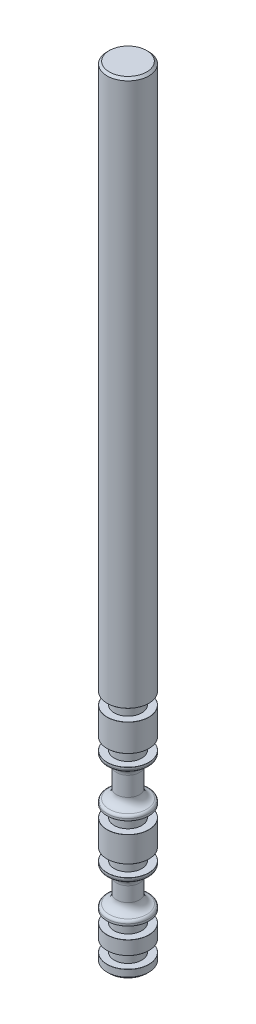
ISO-10303-21;
HEADER;
FILE_DESCRIPTION(('STEP AP214'),'2;1');
FILE_NAME('part.step','',(''),(''),'','','');
FILE_SCHEMA(('AUTOMOTIVE_DESIGN { 1 0 10303 214 1 1 1 1 }'));
ENDSEC;
DATA;
#1=APPLICATION_CONTEXT('core data for automotive mechanical design processes');
#2=APPLICATION_PROTOCOL_DEFINITION('international standard','automotive_design',2000,#1);
#3=PRODUCT_CONTEXT('',#1,'mechanical');
#4=PRODUCT('Part','Part','',(#3));
#5=PRODUCT_RELATED_PRODUCT_CATEGORY('part','',(#4));
#6=PRODUCT_DEFINITION_FORMATION('','',#4);
#7=PRODUCT_DEFINITION_CONTEXT('part definition',#1,'design');
#8=PRODUCT_DEFINITION('design','',#6,#7);
#9=PRODUCT_DEFINITION_SHAPE('','',#8);
#10=(LENGTH_UNIT() NAMED_UNIT(*) SI_UNIT(.MILLI.,.METRE.));
#11=(NAMED_UNIT(*) PLANE_ANGLE_UNIT() SI_UNIT($,.RADIAN.));
#12=(NAMED_UNIT(*) SI_UNIT($,.STERADIAN.) SOLID_ANGLE_UNIT());
#13=UNCERTAINTY_MEASURE_WITH_UNIT(LENGTH_MEASURE(1.E-05),#10,'distance_accuracy_value','');
#14=(GEOMETRIC_REPRESENTATION_CONTEXT(3) GLOBAL_UNCERTAINTY_ASSIGNED_CONTEXT((#13)) GLOBAL_UNIT_ASSIGNED_CONTEXT((#10,
#11,#12)) REPRESENTATION_CONTEXT('',''));
#15=CARTESIAN_POINT('',(0.,0.,0.));
#16=DIRECTION('',(0.,0.,1.));
#17=DIRECTION('',(1.,0.,0.));
#18=AXIS2_PLACEMENT_3D('',#15,#16,#17);
#19=CARTESIAN_POINT('',(0.,-5.94663666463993,0.));
#20=DIRECTION('',(0.,-1.,0.));
#21=DIRECTION('',(0.,0.,-1.));
#22=AXIS2_PLACEMENT_3D('',#19,#20,#21);
#23=CYLINDRICAL_SURFACE('',#22,2.29500000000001);
#24=CARTESIAN_POINT('',(0.,0.250000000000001,0.));
#25=DIRECTION('',(0.,-1.,0.));
#26=DIRECTION('',(0.,0.,-1.));
#27=AXIS2_PLACEMENT_3D('',#24,#25,#26);
#28=CIRCLE('',#27,2.29500000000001);
#29=CARTESIAN_POINT('',(0.,0.250000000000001,-2.29500000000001));
#30=VERTEX_POINT('',#29);
#31=EDGE_CURVE('E45',#30,#30,#28,.F.);
#32=ORIENTED_EDGE('',*,*,#31,.T.);
#33=EDGE_LOOP('',(#32));
#34=FACE_BOUND('',#33,.T.);
#35=CARTESIAN_POINT('',(0.,0.989999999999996,0.));
#36=DIRECTION('',(0.,1.,0.));
#37=DIRECTION('',(0.,0.,1.));
#38=AXIS2_PLACEMENT_3D('',#35,#36,#37);
#39=CIRCLE('',#38,2.29500000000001);
#40=CARTESIAN_POINT('',(0.,0.989999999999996,2.29500000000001));
#41=VERTEX_POINT('',#40);
#42=EDGE_CURVE('E57',#41,#41,#39,.F.);
#43=ORIENTED_EDGE('',*,*,#42,.T.);
#44=EDGE_LOOP('',(#43));
#45=FACE_BOUND('',#44,.T.);
#46=ADVANCED_FACE('F34',(#34,#45),#23,.T.);
#47=CARTESIAN_POINT('',(2.29500000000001,0.,0.));
#48=DIRECTION('',(0.,-1.,0.));
#49=DIRECTION('',(0.,0.,-1.));
#50=AXIS2_PLACEMENT_3D('',#47,#48,#49);
#51=PLANE('',#50);
#52=CARTESIAN_POINT('',(0.,0.,0.));
#53=DIRECTION('',(0.,-1.,0.));
#54=DIRECTION('',(0.,0.,-1.));
#55=AXIS2_PLACEMENT_3D('',#52,#53,#54);
#56=CIRCLE('',#55,2.045);
#57=CARTESIAN_POINT('',(0.,0.,-2.045));
#58=VERTEX_POINT('',#57);
#59=EDGE_CURVE('E49',#58,#58,#56,.T.);
#60=ORIENTED_EDGE('',*,*,#59,.T.);
#61=EDGE_LOOP('',(#60));
#62=FACE_BOUND('',#61,.T.);
#63=ADVANCED_FACE('F220',(#62),#51,.T.);
#64=CARTESIAN_POINT('',(2.5384511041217,2.3,0.));
#65=DIRECTION('',(0.,-1.,0.));
#66=DIRECTION('',(0.,0.,-1.));
#67=AXIS2_PLACEMENT_3D('',#64,#65,#66);
#68=PLANE('',#67);
#69=CARTESIAN_POINT('',(0.,2.3,0.));
#70=DIRECTION('',(0.,-1.,0.));
#71=DIRECTION('',(0.,0.,-1.));
#72=AXIS2_PLACEMENT_3D('',#69,#70,#71);
#73=CIRCLE('',#72,2.285);
#74=CARTESIAN_POINT('',(0.,2.3,2.285));
#75=VERTEX_POINT('',#74);
#76=EDGE_CURVE('E60',#75,#75,#73,.T.);
#77=ORIENTED_EDGE('',*,*,#76,.T.);
#78=EDGE_LOOP('',(#77));
#79=FACE_BOUND('',#78,.T.);
#80=CARTESIAN_POINT('',(0.,2.3,0.));
#81=DIRECTION('',(0.,1.,0.));
#82=DIRECTION('',(0.,0.,1.));
#83=AXIS2_PLACEMENT_3D('',#80,#81,#82);
#84=CIRCLE('',#83,1.51000000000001);
#85=CARTESIAN_POINT('',(0.,2.3,1.51000000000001));
#86=VERTEX_POINT('',#85);
#87=EDGE_CURVE('E180',#86,#86,#84,.T.);
#88=ORIENTED_EDGE('',*,*,#87,.T.);
#89=EDGE_LOOP('',(#88));
#90=FACE_BOUND('',#89,.T.);
#91=ADVANCED_FACE('F226',(#79,#90),#68,.T.);
#92=CARTESIAN_POINT('',(0.,86.3656873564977,0.));
#93=DIRECTION('',(0.,1.,0.));
#94=DIRECTION('',(0.,0.,1.));
#95=AXIS2_PLACEMENT_3D('',#92,#93,#94);
#96=CYLINDRICAL_SURFACE('',#95,1.51000000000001);
#97=CARTESIAN_POINT('',(0.,1.,0.));
#98=DIRECTION('',(0.,1.,0.));
#99=DIRECTION('',(0.,0.,1.));
#100=AXIS2_PLACEMENT_3D('',#97,#98,#99);
#101=CIRCLE('',#100,1.51000000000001);
#102=CARTESIAN_POINT('',(0.,1.,1.51000000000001));
#103=VERTEX_POINT('',#102);
#104=EDGE_CURVE('E183',#103,#103,#101,.T.);
#105=ORIENTED_EDGE('',*,*,#104,.T.);
#106=EDGE_LOOP('',(#105));
#107=FACE_BOUND('',#106,.T.);
#108=ORIENTED_EDGE('',*,*,#87,.F.);
#109=EDGE_LOOP('',(#108));
#110=FACE_BOUND('',#109,.T.);
#111=ADVANCED_FACE('F247',(#107,#110),#96,.T.);
#112=CARTESIAN_POINT('',(1.51000000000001,1.,0.));
#113=DIRECTION('',(0.,1.,0.));
#114=DIRECTION('',(0.,0.,1.));
#115=AXIS2_PLACEMENT_3D('',#112,#113,#114);
#116=PLANE('',#115);
#117=CARTESIAN_POINT('',(0.,1.,0.));
#118=DIRECTION('',(0.,1.,0.));
#119=DIRECTION('',(0.,0.,1.));
#120=AXIS2_PLACEMENT_3D('',#117,#118,#119);
#121=CIRCLE('',#120,2.285);
#122=CARTESIAN_POINT('',(0.,1.,2.285));
#123=VERTEX_POINT('',#122);
#124=EDGE_CURVE('E54',#123,#123,#121,.T.);
#125=ORIENTED_EDGE('',*,*,#124,.T.);
#126=EDGE_LOOP('',(#125));
#127=FACE_BOUND('',#126,.T.);
#128=ORIENTED_EDGE('',*,*,#104,.F.);
#129=EDGE_LOOP('',(#128));
#130=FACE_BOUND('',#129,.T.);
#131=ADVANCED_FACE('F237',(#127,#130),#116,.T.);
#132=CARTESIAN_POINT('',(0.,3.79,0.));
#133=DIRECTION('',(0.,1.,0.));
#134=DIRECTION('',(0.,0.,1.));
#135=AXIS2_PLACEMENT_3D('',#132,#133,#134);
#136=CIRCLE('',#135,2.29500000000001);
#137=CARTESIAN_POINT('',(0.,3.79,2.29500000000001));
#138=VERTEX_POINT('',#137);
#139=EDGE_CURVE('E66',#138,#138,#136,.F.);
#140=ORIENTED_EDGE('',*,*,#139,.T.);
#141=EDGE_LOOP('',(#140));
#142=FACE_BOUND('',#141,.T.);
#143=CARTESIAN_POINT('',(0.,2.31000000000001,0.));
#144=DIRECTION('',(0.,-1.,0.));
#145=DIRECTION('',(0.,0.,-1.));
#146=AXIS2_PLACEMENT_3D('',#143,#144,#145);
#147=CIRCLE('',#146,2.29500000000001);
#148=CARTESIAN_POINT('',(0.,2.31000000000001,2.29500000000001));
#149=VERTEX_POINT('',#148);
#150=EDGE_CURVE('E69',#149,#149,#147,.F.);
#151=ORIENTED_EDGE('',*,*,#150,.T.);
#152=EDGE_LOOP('',(#151));
#153=FACE_BOUND('',#152,.T.);
#154=ADVANCED_FACE('F222',(#142,#153),#23,.T.);
#155=CARTESIAN_POINT('',(2.53845110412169,5.1,0.));
#156=DIRECTION('',(0.,-1.,0.));
#157=DIRECTION('',(0.,0.,-1.));
#158=AXIS2_PLACEMENT_3D('',#155,#156,#157);
#159=PLANE('',#158);
#160=CARTESIAN_POINT('',(0.,5.1,0.));
#161=DIRECTION('',(0.,-1.,0.));
#162=DIRECTION('',(0.,0.,-1.));
#163=AXIS2_PLACEMENT_3D('',#160,#161,#162);
#164=CIRCLE('',#163,2.285);
#165=CARTESIAN_POINT('',(0.,5.1,2.285));
#166=VERTEX_POINT('',#165);
#167=EDGE_CURVE('E72',#166,#166,#164,.T.);
#168=ORIENTED_EDGE('',*,*,#167,.T.);
#169=EDGE_LOOP('',(#168));
#170=FACE_BOUND('',#169,.T.);
#171=CARTESIAN_POINT('',(0.,5.09999999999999,0.));
#172=DIRECTION('',(0.,1.,0.));
#173=DIRECTION('',(0.,0.,1.));
#174=AXIS2_PLACEMENT_3D('',#171,#172,#173);
#175=CIRCLE('',#174,1.51000000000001);
#176=CARTESIAN_POINT('',(0.,5.09999999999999,1.51000000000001));
#177=VERTEX_POINT('',#176);
#178=EDGE_CURVE('E174',#177,#177,#175,.T.);
#179=ORIENTED_EDGE('',*,*,#178,.T.);
#180=EDGE_LOOP('',(#179));
#181=FACE_BOUND('',#180,.T.);
#182=ADVANCED_FACE('F236',(#170,#181),#159,.T.);
#183=CARTESIAN_POINT('',(0.,86.3656873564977,0.));
#184=DIRECTION('',(0.,1.,0.));
#185=DIRECTION('',(0.,0.,1.));
#186=AXIS2_PLACEMENT_3D('',#183,#184,#185);
#187=CYLINDRICAL_SURFACE('',#186,1.51000000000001);
#188=CARTESIAN_POINT('',(0.,3.8,0.));
#189=DIRECTION('',(0.,1.,0.));
#190=DIRECTION('',(0.,0.,1.));
#191=AXIS2_PLACEMENT_3D('',#188,#189,#190);
#192=CIRCLE('',#191,1.51000000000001);
#193=CARTESIAN_POINT('',(0.,3.8,1.51000000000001));
#194=VERTEX_POINT('',#193);
#195=EDGE_CURVE('E177',#194,#194,#192,.T.);
#196=ORIENTED_EDGE('',*,*,#195,.T.);
#197=EDGE_LOOP('',(#196));
#198=FACE_BOUND('',#197,.T.);
#199=ORIENTED_EDGE('',*,*,#178,.F.);
#200=EDGE_LOOP('',(#199));
#201=FACE_BOUND('',#200,.T.);
#202=ADVANCED_FACE('F244',(#198,#201),#187,.T.);
#203=CARTESIAN_POINT('',(1.51000000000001,3.8,0.));
#204=DIRECTION('',(0.,1.,0.));
#205=DIRECTION('',(0.,0.,1.));
#206=AXIS2_PLACEMENT_3D('',#203,#204,#205);
#207=PLANE('',#206);
#208=CARTESIAN_POINT('',(0.,3.8,0.));
#209=DIRECTION('',(0.,1.,0.));
#210=DIRECTION('',(0.,0.,1.));
#211=AXIS2_PLACEMENT_3D('',#208,#209,#210);
#212=CIRCLE('',#211,2.285);
#213=CARTESIAN_POINT('',(0.,3.8,2.285));
#214=VERTEX_POINT('',#213);
#215=EDGE_CURVE('E63',#214,#214,#212,.T.);
#216=ORIENTED_EDGE('',*,*,#215,.T.);
#217=EDGE_LOOP('',(#216));
#218=FACE_BOUND('',#217,.T.);
#219=ORIENTED_EDGE('',*,*,#195,.F.);
#220=EDGE_LOOP('',(#219));
#221=FACE_BOUND('',#220,.T.);
#222=ADVANCED_FACE('F253',(#218,#221),#207,.T.);
#223=CARTESIAN_POINT('',(0.,5.11000000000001,0.));
#224=DIRECTION('',(0.,-1.,0.));
#225=DIRECTION('',(0.,0.,-1.));
#226=AXIS2_PLACEMENT_3D('',#223,#224,#225);
#227=CIRCLE('',#226,2.29500000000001);
#228=CARTESIAN_POINT('',(0.,5.11000000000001,2.29500000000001));
#229=VERTEX_POINT('',#228);
#230=EDGE_CURVE('E75',#229,#229,#227,.F.);
#231=ORIENTED_EDGE('',*,*,#230,.T.);
#232=EDGE_LOOP('',(#231));
#233=FACE_BOUND('',#232,.T.);
#234=CARTESIAN_POINT('',(0.,5.32525492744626,0.));
#235=DIRECTION('',(0.,1.,0.));
#236=DIRECTION('',(0.,0.,1.));
#237=AXIS2_PLACEMENT_3D('',#234,#235,#236);
#238=CIRCLE('',#237,2.29500000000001);
#239=CARTESIAN_POINT('',(0.,5.32525492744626,2.29500000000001));
#240=VERTEX_POINT('',#239);
#241=EDGE_CURVE('E129',#240,#240,#238,.F.);
#242=ORIENTED_EDGE('',*,*,#241,.T.);
#243=EDGE_LOOP('',(#242));
#244=FACE_BOUND('',#243,.T.);
#245=ADVANCED_FACE('F239',(#233,#244),#23,.T.);
#246=CARTESIAN_POINT('',(0.,86.3656873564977,0.));
#247=DIRECTION('',(0.,1.,0.));
#248=DIRECTION('',(0.,0.,1.));
#249=AXIS2_PLACEMENT_3D('',#246,#247,#248);
#250=CYLINDRICAL_SURFACE('',#249,1.25000000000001);
#251=CARTESIAN_POINT('',(0.,6.59999999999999,0.));
#252=DIRECTION('',(0.,1.,0.));
#253=DIRECTION('',(0.,0.,1.));
#254=AXIS2_PLACEMENT_3D('',#251,#252,#253);
#255=CIRCLE('',#254,1.25000000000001);
#256=CARTESIAN_POINT('',(0.,6.59999999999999,1.25000000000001));
#257=VERTEX_POINT('',#256);
#258=EDGE_CURVE('E156',#257,#257,#255,.T.);
#259=ORIENTED_EDGE('',*,*,#258,.T.);
#260=EDGE_LOOP('',(#259));
#261=FACE_BOUND('',#260,.T.);
#262=CARTESIAN_POINT('',(0.,8.2,0.));
#263=DIRECTION('',(0.,-1.,0.));
#264=DIRECTION('',(0.,0.,-1.));
#265=AXIS2_PLACEMENT_3D('',#262,#263,#264);
#266=CIRCLE('',#265,1.25000000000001);
#267=CARTESIAN_POINT('',(0.,8.2,-1.25000000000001));
#268=VERTEX_POINT('',#267);
#269=EDGE_CURVE('E159',#268,#268,#266,.T.);
#270=ORIENTED_EDGE('',*,*,#269,.T.);
#271=EDGE_LOOP('',(#270));
#272=FACE_BOUND('',#271,.T.);
#273=ADVANCED_FACE('F252',(#261,#272),#250,.T.);
#274=CARTESIAN_POINT('',(0.,9.68999999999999,0.));
#275=DIRECTION('',(0.,1.,0.));
#276=DIRECTION('',(0.,0.,1.));
#277=AXIS2_PLACEMENT_3D('',#274,#275,#276);
#278=CIRCLE('',#277,2.29500000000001);
#279=CARTESIAN_POINT('',(0.,9.68999999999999,-2.29500000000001));
#280=VERTEX_POINT('',#279);
#281=EDGE_CURVE('E81',#280,#280,#278,.F.);
#282=ORIENTED_EDGE('',*,*,#281,.T.);
#283=EDGE_LOOP('',(#282));
#284=FACE_BOUND('',#283,.T.);
#285=CARTESIAN_POINT('',(0.,9.47474507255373,0.));
#286=DIRECTION('',(0.,-1.,0.));
#287=DIRECTION('',(0.,0.,-1.));
#288=AXIS2_PLACEMENT_3D('',#285,#286,#287);
#289=CIRCLE('',#288,2.29500000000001);
#290=CARTESIAN_POINT('',(0.,9.47474507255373,-2.29500000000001));
#291=VERTEX_POINT('',#290);
#292=EDGE_CURVE('E135',#291,#291,#289,.F.);
#293=ORIENTED_EDGE('',*,*,#292,.T.);
#294=EDGE_LOOP('',(#293));
#295=FACE_BOUND('',#294,.T.);
#296=ADVANCED_FACE('F255',(#284,#295),#23,.T.);
#297=CARTESIAN_POINT('',(1.51000000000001,11.,0.));
#298=DIRECTION('',(0.,-1.,0.));
#299=DIRECTION('',(0.,0.,-1.));
#300=AXIS2_PLACEMENT_3D('',#297,#298,#299);
#301=PLANE('',#300);
#302=CARTESIAN_POINT('',(0.,11.,0.));
#303=DIRECTION('',(0.,-1.,0.));
#304=DIRECTION('',(0.,0.,-1.));
#305=AXIS2_PLACEMENT_3D('',#302,#303,#304);
#306=CIRCLE('',#305,2.28500000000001);
#307=CARTESIAN_POINT('',(0.,11.,-2.28500000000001));
#308=VERTEX_POINT('',#307);
#309=EDGE_CURVE('E84',#308,#308,#306,.T.);
#310=ORIENTED_EDGE('',*,*,#309,.T.);
#311=EDGE_LOOP('',(#310));
#312=FACE_BOUND('',#311,.T.);
#313=CARTESIAN_POINT('',(0.,11.,0.));
#314=DIRECTION('',(0.,1.,0.));
#315=DIRECTION('',(0.,0.,1.));
#316=AXIS2_PLACEMENT_3D('',#313,#314,#315);
#317=CIRCLE('',#316,1.51000000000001);
#318=CARTESIAN_POINT('',(0.,11.,1.51000000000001));
#319=VERTEX_POINT('',#318);
#320=EDGE_CURVE('E168',#319,#319,#317,.T.);
#321=ORIENTED_EDGE('',*,*,#320,.T.);
#322=EDGE_LOOP('',(#321));
#323=FACE_BOUND('',#322,.T.);
#324=ADVANCED_FACE('F266',(#312,#323),#301,.T.);
#325=CARTESIAN_POINT('',(0.,86.3656873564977,0.));
#326=DIRECTION('',(0.,1.,0.));
#327=DIRECTION('',(0.,0.,1.));
#328=AXIS2_PLACEMENT_3D('',#325,#326,#327);
#329=CYLINDRICAL_SURFACE('',#328,1.51000000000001);
#330=CARTESIAN_POINT('',(0.,9.7,0.));
#331=DIRECTION('',(0.,1.,0.));
#332=DIRECTION('',(0.,0.,1.));
#333=AXIS2_PLACEMENT_3D('',#330,#331,#332);
#334=CIRCLE('',#333,1.51000000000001);
#335=CARTESIAN_POINT('',(0.,9.7,1.51000000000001));
#336=VERTEX_POINT('',#335);
#337=EDGE_CURVE('E171',#336,#336,#334,.T.);
#338=ORIENTED_EDGE('',*,*,#337,.T.);
#339=EDGE_LOOP('',(#338));
#340=FACE_BOUND('',#339,.T.);
#341=ORIENTED_EDGE('',*,*,#320,.F.);
#342=EDGE_LOOP('',(#341));
#343=FACE_BOUND('',#342,.T.);
#344=ADVANCED_FACE('F272',(#340,#343),#329,.T.);
#345=CARTESIAN_POINT('',(1.51000000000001,9.7,0.));
#346=DIRECTION('',(0.,1.,0.));
#347=DIRECTION('',(0.,0.,1.));
#348=AXIS2_PLACEMENT_3D('',#345,#346,#347);
#349=PLANE('',#348);
#350=CARTESIAN_POINT('',(0.,9.7,0.));
#351=DIRECTION('',(0.,1.,0.));
#352=DIRECTION('',(0.,0.,1.));
#353=AXIS2_PLACEMENT_3D('',#350,#351,#352);
#354=CIRCLE('',#353,2.285);
#355=CARTESIAN_POINT('',(0.,9.7,-2.285));
#356=VERTEX_POINT('',#355);
#357=EDGE_CURVE('E78',#356,#356,#354,.T.);
#358=ORIENTED_EDGE('',*,*,#357,.T.);
#359=EDGE_LOOP('',(#358));
#360=FACE_BOUND('',#359,.T.);
#361=ORIENTED_EDGE('',*,*,#337,.F.);
#362=EDGE_LOOP('',(#361));
#363=FACE_BOUND('',#362,.T.);
#364=ADVANCED_FACE('F278',(#360,#363),#349,.T.);
#365=CARTESIAN_POINT('',(0.,13.79,0.));
#366=DIRECTION('',(0.,1.,0.));
#367=DIRECTION('',(0.,0.,1.));
#368=AXIS2_PLACEMENT_3D('',#365,#366,#367);
#369=CIRCLE('',#368,2.29500000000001);
#370=CARTESIAN_POINT('',(0.,13.79,2.29500000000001));
#371=VERTEX_POINT('',#370);
#372=EDGE_CURVE('E90',#371,#371,#369,.F.);
#373=ORIENTED_EDGE('',*,*,#372,.T.);
#374=EDGE_LOOP('',(#373));
#375=FACE_BOUND('',#374,.T.);
#376=CARTESIAN_POINT('',(0.,11.01,0.));
#377=DIRECTION('',(0.,-1.,0.));
#378=DIRECTION('',(0.,0.,-1.));
#379=AXIS2_PLACEMENT_3D('',#376,#377,#378);
#380=CIRCLE('',#379,2.29500000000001);
#381=CARTESIAN_POINT('',(0.,11.01,-2.29500000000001));
#382=VERTEX_POINT('',#381);
#383=EDGE_CURVE('E93',#382,#382,#380,.F.);
#384=ORIENTED_EDGE('',*,*,#383,.T.);
#385=EDGE_LOOP('',(#384));
#386=FACE_BOUND('',#385,.T.);
#387=ADVANCED_FACE('F268',(#375,#386),#23,.T.);
#388=CARTESIAN_POINT('',(2.5384511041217,15.1,0.));
#389=DIRECTION('',(0.,-1.,0.));
#390=DIRECTION('',(0.,0.,-1.));
#391=AXIS2_PLACEMENT_3D('',#388,#389,#390);
#392=PLANE('',#391);
#393=CARTESIAN_POINT('',(0.,15.1,0.));
#394=DIRECTION('',(0.,-1.,0.));
#395=DIRECTION('',(0.,0.,-1.));
#396=AXIS2_PLACEMENT_3D('',#393,#394,#395);
#397=CIRCLE('',#396,2.28500000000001);
#398=CARTESIAN_POINT('',(0.,15.1,-2.28500000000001));
#399=VERTEX_POINT('',#398);
#400=EDGE_CURVE('E96',#399,#399,#397,.T.);
#401=ORIENTED_EDGE('',*,*,#400,.T.);
#402=EDGE_LOOP('',(#401));
#403=FACE_BOUND('',#402,.T.);
#404=CARTESIAN_POINT('',(0.,15.1,0.));
#405=DIRECTION('',(0.,1.,0.));
#406=DIRECTION('',(0.,0.,1.));
#407=AXIS2_PLACEMENT_3D('',#404,#405,#406);
#408=CIRCLE('',#407,1.51000000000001);
#409=CARTESIAN_POINT('',(0.,15.1,1.51000000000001));
#410=VERTEX_POINT('',#409);
#411=EDGE_CURVE('E162',#410,#410,#408,.T.);
#412=ORIENTED_EDGE('',*,*,#411,.T.);
#413=EDGE_LOOP('',(#412));
#414=FACE_BOUND('',#413,.T.);
#415=ADVANCED_FACE('F277',(#403,#414),#392,.T.);
#416=CARTESIAN_POINT('',(0.,86.3656873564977,0.));
#417=DIRECTION('',(0.,1.,0.));
#418=DIRECTION('',(0.,0.,1.));
#419=AXIS2_PLACEMENT_3D('',#416,#417,#418);
#420=CYLINDRICAL_SURFACE('',#419,1.51000000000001);
#421=CARTESIAN_POINT('',(0.,13.8,0.));
#422=DIRECTION('',(0.,1.,0.));
#423=DIRECTION('',(0.,0.,1.));
#424=AXIS2_PLACEMENT_3D('',#421,#422,#423);
#425=CIRCLE('',#424,1.51000000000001);
#426=CARTESIAN_POINT('',(0.,13.8,1.51000000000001));
#427=VERTEX_POINT('',#426);
#428=EDGE_CURVE('E165',#427,#427,#425,.T.);
#429=ORIENTED_EDGE('',*,*,#428,.T.);
#430=EDGE_LOOP('',(#429));
#431=FACE_BOUND('',#430,.T.);
#432=ORIENTED_EDGE('',*,*,#411,.F.);
#433=EDGE_LOOP('',(#432));
#434=FACE_BOUND('',#433,.T.);
#435=ADVANCED_FACE('F284',(#431,#434),#420,.T.);
#436=CARTESIAN_POINT('',(1.51000000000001,13.8,0.));
#437=DIRECTION('',(0.,1.,0.));
#438=DIRECTION('',(0.,0.,1.));
#439=AXIS2_PLACEMENT_3D('',#436,#437,#438);
#440=PLANE('',#439);
#441=CARTESIAN_POINT('',(0.,13.8,0.));
#442=DIRECTION('',(0.,1.,0.));
#443=DIRECTION('',(0.,0.,1.));
#444=AXIS2_PLACEMENT_3D('',#441,#442,#443);
#445=CIRCLE('',#444,2.285);
#446=CARTESIAN_POINT('',(0.,13.8,2.285));
#447=VERTEX_POINT('',#446);
#448=EDGE_CURVE('E87',#447,#447,#445,.T.);
#449=ORIENTED_EDGE('',*,*,#448,.T.);
#450=EDGE_LOOP('',(#449));
#451=FACE_BOUND('',#450,.T.);
#452=ORIENTED_EDGE('',*,*,#428,.F.);
#453=EDGE_LOOP('',(#452));
#454=FACE_BOUND('',#453,.T.);
#455=ADVANCED_FACE('F292',(#451,#454),#440,.T.);
#456=CARTESIAN_POINT('',(0.,15.11,0.));
#457=DIRECTION('',(0.,-1.,0.));
#458=DIRECTION('',(0.,0.,-1.));
#459=AXIS2_PLACEMENT_3D('',#456,#457,#458);
#460=CIRCLE('',#459,2.29500000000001);
#461=CARTESIAN_POINT('',(0.,15.11,-2.29500000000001));
#462=VERTEX_POINT('',#461);
#463=EDGE_CURVE('E99',#462,#462,#460,.F.);
#464=ORIENTED_EDGE('',*,*,#463,.T.);
#465=EDGE_LOOP('',(#464));
#466=FACE_BOUND('',#465,.T.);
#467=CARTESIAN_POINT('',(0.,15.3252549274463,0.));
#468=DIRECTION('',(0.,1.,0.));
#469=DIRECTION('',(0.,0.,1.));
#470=AXIS2_PLACEMENT_3D('',#467,#468,#469);
#471=CIRCLE('',#470,2.29500000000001);
#472=CARTESIAN_POINT('',(0.,15.3252549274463,2.29500000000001));
#473=VERTEX_POINT('',#472);
#474=EDGE_CURVE('E141',#473,#473,#471,.F.);
#475=ORIENTED_EDGE('',*,*,#474,.T.);
#476=EDGE_LOOP('',(#475));
#477=FACE_BOUND('',#476,.T.);
#478=ADVANCED_FACE('F230',(#466,#477),#23,.T.);
#479=CARTESIAN_POINT('',(0.,86.3656873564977,0.));
#480=DIRECTION('',(0.,1.,0.));
#481=DIRECTION('',(0.,0.,1.));
#482=AXIS2_PLACEMENT_3D('',#479,#480,#481);
#483=CYLINDRICAL_SURFACE('',#482,1.25000000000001);
#484=CARTESIAN_POINT('',(0.,16.6,0.));
#485=DIRECTION('',(0.,1.,0.));
#486=DIRECTION('',(0.,0.,1.));
#487=AXIS2_PLACEMENT_3D('',#484,#485,#486);
#488=CIRCLE('',#487,1.25000000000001);
#489=CARTESIAN_POINT('',(0.,16.6,1.25000000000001));
#490=VERTEX_POINT('',#489);
#491=EDGE_CURVE('E150',#490,#490,#488,.T.);
#492=ORIENTED_EDGE('',*,*,#491,.T.);
#493=EDGE_LOOP('',(#492));
#494=FACE_BOUND('',#493,.T.);
#495=CARTESIAN_POINT('',(0.,18.7,0.));
#496=DIRECTION('',(0.,-1.,0.));
#497=DIRECTION('',(0.,0.,-1.));
#498=AXIS2_PLACEMENT_3D('',#495,#496,#497);
#499=CIRCLE('',#498,1.25000000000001);
#500=CARTESIAN_POINT('',(0.,18.7,-1.25000000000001));
#501=VERTEX_POINT('',#500);
#502=EDGE_CURVE('E153',#501,#501,#499,.T.);
#503=ORIENTED_EDGE('',*,*,#502,.T.);
#504=EDGE_LOOP('',(#503));
#505=FACE_BOUND('',#504,.T.);
#506=ADVANCED_FACE('F291',(#494,#505),#483,.T.);
#507=CARTESIAN_POINT('',(0.,20.19,0.));
#508=DIRECTION('',(0.,1.,0.));
#509=DIRECTION('',(0.,0.,1.));
#510=AXIS2_PLACEMENT_3D('',#507,#508,#509);
#511=CIRCLE('',#510,2.29500000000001);
#512=CARTESIAN_POINT('',(0.,20.19,2.29500000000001));
#513=VERTEX_POINT('',#512);
#514=EDGE_CURVE('E105',#513,#513,#511,.F.);
#515=ORIENTED_EDGE('',*,*,#514,.T.);
#516=EDGE_LOOP('',(#515));
#517=FACE_BOUND('',#516,.T.);
#518=CARTESIAN_POINT('',(0.,19.9747450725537,0.));
#519=DIRECTION('',(0.,-1.,0.));
#520=DIRECTION('',(0.,0.,-1.));
#521=AXIS2_PLACEMENT_3D('',#518,#519,#520);
#522=CIRCLE('',#521,2.29500000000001);
#523=CARTESIAN_POINT('',(0.,19.9747450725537,-2.29500000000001));
#524=VERTEX_POINT('',#523);
#525=EDGE_CURVE('E147',#524,#524,#522,.F.);
#526=ORIENTED_EDGE('',*,*,#525,.T.);
#527=EDGE_LOOP('',(#526));
#528=FACE_BOUND('',#527,.T.);
#529=ADVANCED_FACE('F214',(#517,#528),#23,.T.);
#530=CARTESIAN_POINT('',(1.51000000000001,21.5,0.));
#531=DIRECTION('',(0.,-1.,0.));
#532=DIRECTION('',(0.,0.,-1.));
#533=AXIS2_PLACEMENT_3D('',#530,#531,#532);
#534=PLANE('',#533);
#535=CARTESIAN_POINT('',(0.,21.5,0.));
#536=DIRECTION('',(0.,-1.,0.));
#537=DIRECTION('',(0.,0.,-1.));
#538=AXIS2_PLACEMENT_3D('',#535,#536,#537);
#539=CIRCLE('',#538,2.285);
#540=CARTESIAN_POINT('',(0.,21.5,-2.285));
#541=VERTEX_POINT('',#540);
#542=EDGE_CURVE('E108',#541,#541,#539,.T.);
#543=ORIENTED_EDGE('',*,*,#542,.T.);
#544=EDGE_LOOP('',(#543));
#545=FACE_BOUND('',#544,.T.);
#546=CARTESIAN_POINT('',(0.,21.5,0.));
#547=DIRECTION('',(0.,1.,0.));
#548=DIRECTION('',(0.,0.,1.));
#549=AXIS2_PLACEMENT_3D('',#546,#547,#548);
#550=CIRCLE('',#549,1.51000000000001);
#551=CARTESIAN_POINT('',(0.,21.5,1.51000000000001));
#552=VERTEX_POINT('',#551);
#553=EDGE_CURVE('E192',#552,#552,#550,.T.);
#554=ORIENTED_EDGE('',*,*,#553,.T.);
#555=EDGE_LOOP('',(#554));
#556=FACE_BOUND('',#555,.T.);
#557=ADVANCED_FACE('F216',(#545,#556),#534,.T.);
#558=CARTESIAN_POINT('',(0.,86.3656873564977,0.));
#559=DIRECTION('',(0.,1.,0.));
#560=DIRECTION('',(0.,0.,1.));
#561=AXIS2_PLACEMENT_3D('',#558,#559,#560);
#562=CYLINDRICAL_SURFACE('',#561,1.51000000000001);
#563=CARTESIAN_POINT('',(0.,20.2,0.));
#564=DIRECTION('',(0.,1.,0.));
#565=DIRECTION('',(0.,0.,1.));
#566=AXIS2_PLACEMENT_3D('',#563,#564,#565);
#567=CIRCLE('',#566,1.51000000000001);
#568=CARTESIAN_POINT('',(0.,20.2,1.51000000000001));
#569=VERTEX_POINT('',#568);
#570=EDGE_CURVE('E195',#569,#569,#567,.T.);
#571=ORIENTED_EDGE('',*,*,#570,.T.);
#572=EDGE_LOOP('',(#571));
#573=FACE_BOUND('',#572,.T.);
#574=ORIENTED_EDGE('',*,*,#553,.F.);
#575=EDGE_LOOP('',(#574));
#576=FACE_BOUND('',#575,.T.);
#577=ADVANCED_FACE('F199',(#573,#576),#562,.T.);
#578=CARTESIAN_POINT('',(1.51000000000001,20.2,0.));
#579=DIRECTION('',(0.,1.,0.));
#580=DIRECTION('',(0.,0.,1.));
#581=AXIS2_PLACEMENT_3D('',#578,#579,#580);
#582=PLANE('',#581);
#583=CARTESIAN_POINT('',(0.,20.2,0.));
#584=DIRECTION('',(0.,1.,0.));
#585=DIRECTION('',(0.,0.,1.));
#586=AXIS2_PLACEMENT_3D('',#583,#584,#585);
#587=CIRCLE('',#586,2.28500000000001);
#588=CARTESIAN_POINT('',(0.,20.2,2.28500000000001));
#589=VERTEX_POINT('',#588);
#590=EDGE_CURVE('E102',#589,#589,#587,.T.);
#591=ORIENTED_EDGE('',*,*,#590,.T.);
#592=EDGE_LOOP('',(#591));
#593=FACE_BOUND('',#592,.T.);
#594=ORIENTED_EDGE('',*,*,#570,.F.);
#595=EDGE_LOOP('',(#594));
#596=FACE_BOUND('',#595,.T.);
#597=ADVANCED_FACE('F202',(#593,#596),#582,.T.);
#598=CARTESIAN_POINT('',(0.,24.49,0.));
#599=DIRECTION('',(0.,1.,0.));
#600=DIRECTION('',(0.,0.,1.));
#601=AXIS2_PLACEMENT_3D('',#598,#599,#600);
#602=CIRCLE('',#601,2.29500000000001);
#603=CARTESIAN_POINT('',(0.,24.49,2.29500000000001));
#604=VERTEX_POINT('',#603);
#605=EDGE_CURVE('E114',#604,#604,#602,.F.);
#606=ORIENTED_EDGE('',*,*,#605,.T.);
#607=EDGE_LOOP('',(#606));
#608=FACE_BOUND('',#607,.T.);
#609=CARTESIAN_POINT('',(0.,21.51,0.));
#610=DIRECTION('',(0.,-1.,0.));
#611=DIRECTION('',(0.,0.,-1.));
#612=AXIS2_PLACEMENT_3D('',#609,#610,#611);
#613=CIRCLE('',#612,2.29500000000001);
#614=CARTESIAN_POINT('',(0.,21.51,-2.29500000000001));
#615=VERTEX_POINT('',#614);
#616=EDGE_CURVE('E117',#615,#615,#613,.F.);
#617=ORIENTED_EDGE('',*,*,#616,.T.);
#618=EDGE_LOOP('',(#617));
#619=FACE_BOUND('',#618,.T.);
#620=ADVANCED_FACE('F204',(#608,#619),#23,.T.);
#621=CARTESIAN_POINT('',(1.51000000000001,25.8,0.));
#622=DIRECTION('',(0.,-1.,0.));
#623=DIRECTION('',(0.,0.,-1.));
#624=AXIS2_PLACEMENT_3D('',#621,#622,#623);
#625=PLANE('',#624);
#626=CARTESIAN_POINT('',(0.,25.8,0.));
#627=DIRECTION('',(0.,-1.,0.));
#628=DIRECTION('',(0.,0.,-1.));
#629=AXIS2_PLACEMENT_3D('',#626,#627,#628);
#630=CIRCLE('',#629,2.285);
#631=CARTESIAN_POINT('',(0.,25.8,-2.285));
#632=VERTEX_POINT('',#631);
#633=EDGE_CURVE('E120',#632,#632,#630,.T.);
#634=ORIENTED_EDGE('',*,*,#633,.T.);
#635=EDGE_LOOP('',(#634));
#636=FACE_BOUND('',#635,.T.);
#637=CARTESIAN_POINT('',(0.,25.8,0.));
#638=DIRECTION('',(0.,1.,0.));
#639=DIRECTION('',(0.,0.,1.));
#640=AXIS2_PLACEMENT_3D('',#637,#638,#639);
#641=CIRCLE('',#640,1.51000000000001);
#642=CARTESIAN_POINT('',(0.,25.8,1.51000000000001));
#643=VERTEX_POINT('',#642);
#644=EDGE_CURVE('E186',#643,#643,#641,.T.);
#645=ORIENTED_EDGE('',*,*,#644,.T.);
#646=EDGE_LOOP('',(#645));
#647=FACE_BOUND('',#646,.T.);
#648=ADVANCED_FACE('F211',(#636,#647),#625,.T.);
#649=CARTESIAN_POINT('',(0.,86.3656873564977,0.));
#650=DIRECTION('',(0.,1.,0.));
#651=DIRECTION('',(0.,0.,1.));
#652=AXIS2_PLACEMENT_3D('',#649,#650,#651);
#653=CYLINDRICAL_SURFACE('',#652,1.51000000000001);
#654=CARTESIAN_POINT('',(0.,24.5,0.));
#655=DIRECTION('',(0.,1.,0.));
#656=DIRECTION('',(0.,0.,1.));
#657=AXIS2_PLACEMENT_3D('',#654,#655,#656);
#658=CIRCLE('',#657,1.51000000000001);
#659=CARTESIAN_POINT('',(0.,24.5,1.51000000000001));
#660=VERTEX_POINT('',#659);
#661=EDGE_CURVE('E189',#660,#660,#658,.T.);
#662=ORIENTED_EDGE('',*,*,#661,.T.);
#663=EDGE_LOOP('',(#662));
#664=FACE_BOUND('',#663,.T.);
#665=ORIENTED_EDGE('',*,*,#644,.F.);
#666=EDGE_LOOP('',(#665));
#667=FACE_BOUND('',#666,.T.);
#668=ADVANCED_FACE('F514',(#664,#667),#653,.T.);
#669=CARTESIAN_POINT('',(2.5384511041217,24.5,0.));
#670=DIRECTION('',(0.,1.,0.));
#671=DIRECTION('',(0.,0.,1.));
#672=AXIS2_PLACEMENT_3D('',#669,#670,#671);
#673=PLANE('',#672);
#674=CARTESIAN_POINT('',(0.,24.5,0.));
#675=DIRECTION('',(0.,1.,0.));
#676=DIRECTION('',(0.,0.,1.));
#677=AXIS2_PLACEMENT_3D('',#674,#675,#676);
#678=CIRCLE('',#677,2.28500000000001);
#679=CARTESIAN_POINT('',(0.,24.5,2.28500000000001));
#680=VERTEX_POINT('',#679);
#681=EDGE_CURVE('E111',#680,#680,#678,.T.);
#682=ORIENTED_EDGE('',*,*,#681,.T.);
#683=EDGE_LOOP('',(#682));
#684=FACE_BOUND('',#683,.T.);
#685=ORIENTED_EDGE('',*,*,#661,.F.);
#686=EDGE_LOOP('',(#685));
#687=FACE_BOUND('',#686,.T.);
#688=ADVANCED_FACE('F422',(#684,#687),#673,.T.);
#689=CARTESIAN_POINT('',(0.,85.69,0.));
#690=DIRECTION('',(0.,1.,0.));
#691=DIRECTION('',(0.,0.,1.));
#692=AXIS2_PLACEMENT_3D('',#689,#690,#691);
#693=PLANE('',#692);
#694=CARTESIAN_POINT('',(0.,85.69,0.));
#695=DIRECTION('',(0.,1.,0.));
#696=DIRECTION('',(0.,0.,1.));
#697=AXIS2_PLACEMENT_3D('',#694,#695,#696);
#698=CIRCLE('',#697,2.04499999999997);
#699=CARTESIAN_POINT('',(0.,85.69,2.04499999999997));
#700=VERTEX_POINT('',#699);
#701=EDGE_CURVE('E10',#700,#700,#698,.T.);
#702=ORIENTED_EDGE('',*,*,#701,.T.);
#703=EDGE_LOOP('',(#702));
#704=FACE_BOUND('',#703,.T.);
#705=ADVANCED_FACE('F234',(#704),#693,.T.);
#706=CARTESIAN_POINT('',(0.,85.44,0.));
#707=DIRECTION('',(0.,1.,0.));
#708=DIRECTION('',(0.,0.,1.));
#709=AXIS2_PLACEMENT_3D('',#706,#707,#708);
#710=CIRCLE('',#709,2.29500000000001);
#711=CARTESIAN_POINT('',(0.,85.44,2.29500000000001));
#712=VERTEX_POINT('',#711);
#713=EDGE_CURVE('E41',#712,#712,#710,.F.);
#714=ORIENTED_EDGE('',*,*,#713,.T.);
#715=EDGE_LOOP('',(#714));
#716=FACE_BOUND('',#715,.T.);
#717=CARTESIAN_POINT('',(0.,25.81,0.));
#718=DIRECTION('',(0.,-1.,0.));
#719=DIRECTION('',(0.,0.,-1.));
#720=AXIS2_PLACEMENT_3D('',#717,#718,#719);
#721=CIRCLE('',#720,2.29500000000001);
#722=CARTESIAN_POINT('',(0.,25.81,-2.29500000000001));
#723=VERTEX_POINT('',#722);
#724=EDGE_CURVE('E123',#723,#723,#721,.F.);
#725=ORIENTED_EDGE('',*,*,#724,.T.);
#726=EDGE_LOOP('',(#725));
#727=FACE_BOUND('',#726,.T.);
#728=ADVANCED_FACE('F215',(#716,#727),#23,.T.);
#729=CARTESIAN_POINT('',(0.,6.59999999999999,0.));
#730=DIRECTION('',(0.,1.,0.));
#731=DIRECTION('',(0.,0.,1.));
#732=AXIS2_PLACEMENT_3D('',#729,#730,#731);
#733=TOROIDAL_SURFACE('',#732,2.25000000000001,1.);
#734=CARTESIAN_POINT('',(0.,5.61942686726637,0.));
#735=DIRECTION('',(0.,1.,0.));
#736=DIRECTION('',(0.,0.,1.));
#737=AXIS2_PLACEMENT_3D('',#734,#735,#736);
#738=CIRCLE('',#737,2.05384615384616);
#739=CARTESIAN_POINT('',(0.,5.61942686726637,2.05384615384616));
#740=VERTEX_POINT('',#739);
#741=EDGE_CURVE('E126',#740,#740,#738,.T.);
#742=ORIENTED_EDGE('',*,*,#741,.T.);
#743=EDGE_LOOP('',(#742));
#744=FACE_BOUND('',#743,.T.);
#745=ORIENTED_EDGE('',*,*,#258,.F.);
#746=EDGE_LOOP('',(#745));
#747=FACE_BOUND('',#746,.T.);
#748=ADVANCED_FACE('F233',(#744,#747),#733,.F.);
#749=CARTESIAN_POINT('',(0.,8.2,0.));
#750=DIRECTION('',(0.,-1.,0.));
#751=DIRECTION('',(0.,0.,-1.));
#752=AXIS2_PLACEMENT_3D('',#749,#750,#751);
#753=TOROIDAL_SURFACE('',#752,2.25000000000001,1.);
#754=CARTESIAN_POINT('',(0.,9.18057313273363,0.));
#755=DIRECTION('',(0.,-1.,0.));
#756=DIRECTION('',(0.,0.,-1.));
#757=AXIS2_PLACEMENT_3D('',#754,#755,#756);
#758=CIRCLE('',#757,2.05384615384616);
#759=CARTESIAN_POINT('',(0.,9.18057313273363,-2.05384615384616));
#760=VERTEX_POINT('',#759);
#761=EDGE_CURVE('E132',#760,#760,#758,.T.);
#762=ORIENTED_EDGE('',*,*,#761,.T.);
#763=EDGE_LOOP('',(#762));
#764=FACE_BOUND('',#763,.T.);
#765=ORIENTED_EDGE('',*,*,#269,.F.);
#766=EDGE_LOOP('',(#765));
#767=FACE_BOUND('',#766,.T.);
#768=ADVANCED_FACE('F661',(#764,#767),#753,.F.);
#769=CARTESIAN_POINT('',(0.,16.6,0.));
#770=DIRECTION('',(0.,1.,0.));
#771=DIRECTION('',(0.,0.,1.));
#772=AXIS2_PLACEMENT_3D('',#769,#770,#771);
#773=TOROIDAL_SURFACE('',#772,2.25000000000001,1.);
#774=CARTESIAN_POINT('',(0.,15.6194268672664,0.));
#775=DIRECTION('',(0.,1.,0.));
#776=DIRECTION('',(0.,0.,1.));
#777=AXIS2_PLACEMENT_3D('',#774,#775,#776);
#778=CIRCLE('',#777,2.05384615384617);
#779=CARTESIAN_POINT('',(0.,15.6194268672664,2.05384615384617));
#780=VERTEX_POINT('',#779);
#781=EDGE_CURVE('E138',#780,#780,#778,.T.);
#782=ORIENTED_EDGE('',*,*,#781,.T.);
#783=EDGE_LOOP('',(#782));
#784=FACE_BOUND('',#783,.T.);
#785=ORIENTED_EDGE('',*,*,#491,.F.);
#786=EDGE_LOOP('',(#785));
#787=FACE_BOUND('',#786,.T.);
#788=ADVANCED_FACE('F326',(#784,#787),#773,.F.);
#789=CARTESIAN_POINT('',(0.,18.7,0.));
#790=DIRECTION('',(0.,-1.,0.));
#791=DIRECTION('',(0.,0.,-1.));
#792=AXIS2_PLACEMENT_3D('',#789,#790,#791);
#793=TOROIDAL_SURFACE('',#792,2.25000000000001,1.);
#794=CARTESIAN_POINT('',(0.,19.6805731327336,0.));
#795=DIRECTION('',(0.,-1.,0.));
#796=DIRECTION('',(0.,0.,-1.));
#797=AXIS2_PLACEMENT_3D('',#794,#795,#796);
#798=CIRCLE('',#797,2.05384615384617);
#799=CARTESIAN_POINT('',(0.,19.6805731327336,-2.05384615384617));
#800=VERTEX_POINT('',#799);
#801=EDGE_CURVE('E144',#800,#800,#798,.T.);
#802=ORIENTED_EDGE('',*,*,#801,.T.);
#803=EDGE_LOOP('',(#802));
#804=FACE_BOUND('',#803,.T.);
#805=ORIENTED_EDGE('',*,*,#502,.F.);
#806=EDGE_LOOP('',(#805));
#807=FACE_BOUND('',#806,.T.);
#808=ADVANCED_FACE('F316',(#804,#807),#793,.F.);
#809=CARTESIAN_POINT('',(0.,19.9747450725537,0.));
#810=DIRECTION('',(0.,-1.,0.));
#811=DIRECTION('',(0.,0.,-1.));
#812=AXIS2_PLACEMENT_3D('',#809,#810,#811);
#813=TOROIDAL_SURFACE('',#812,1.99500000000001,0.3);
#814=ORIENTED_EDGE('',*,*,#801,.F.);
#815=EDGE_LOOP('',(#814));
#816=FACE_BOUND('',#815,.T.);
#817=ORIENTED_EDGE('',*,*,#525,.F.);
#818=EDGE_LOOP('',(#817));
#819=FACE_BOUND('',#818,.T.);
#820=ADVANCED_FACE('F313',(#816,#819),#813,.T.);
#821=CARTESIAN_POINT('',(0.,15.3252549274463,0.));
#822=DIRECTION('',(0.,1.,0.));
#823=DIRECTION('',(0.,0.,1.));
#824=AXIS2_PLACEMENT_3D('',#821,#822,#823);
#825=TOROIDAL_SURFACE('',#824,1.99500000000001,0.3);
#826=ORIENTED_EDGE('',*,*,#781,.F.);
#827=EDGE_LOOP('',(#826));
#828=FACE_BOUND('',#827,.T.);
#829=ORIENTED_EDGE('',*,*,#474,.F.);
#830=EDGE_LOOP('',(#829));
#831=FACE_BOUND('',#830,.T.);
#832=ADVANCED_FACE('F315',(#828,#831),#825,.T.);
#833=CARTESIAN_POINT('',(0.,9.47474507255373,0.));
#834=DIRECTION('',(0.,-1.,0.));
#835=DIRECTION('',(0.,0.,-1.));
#836=AXIS2_PLACEMENT_3D('',#833,#834,#835);
#837=TOROIDAL_SURFACE('',#836,1.99500000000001,0.3);
#838=ORIENTED_EDGE('',*,*,#761,.F.);
#839=EDGE_LOOP('',(#838));
#840=FACE_BOUND('',#839,.T.);
#841=ORIENTED_EDGE('',*,*,#292,.F.);
#842=EDGE_LOOP('',(#841));
#843=FACE_BOUND('',#842,.T.);
#844=ADVANCED_FACE('F323',(#840,#843),#837,.T.);
#845=CARTESIAN_POINT('',(0.,5.32525492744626,0.));
#846=DIRECTION('',(0.,1.,0.));
#847=DIRECTION('',(0.,0.,1.));
#848=AXIS2_PLACEMENT_3D('',#845,#846,#847);
#849=TOROIDAL_SURFACE('',#848,1.99500000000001,0.3);
#850=ORIENTED_EDGE('',*,*,#741,.F.);
#851=EDGE_LOOP('',(#850));
#852=FACE_BOUND('',#851,.T.);
#853=ORIENTED_EDGE('',*,*,#241,.F.);
#854=EDGE_LOOP('',(#853));
#855=FACE_BOUND('',#854,.T.);
#856=ADVANCED_FACE('F334',(#852,#855),#849,.T.);
#857=CARTESIAN_POINT('',(0.,25.81,0.));
#858=DIRECTION('',(0.,1.,0.));
#859=DIRECTION('',(0.,0.,1.));
#860=AXIS2_PLACEMENT_3D('',#857,#858,#859);
#861=CONICAL_SURFACE('',#860,2.29500000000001,0.785398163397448);
#862=ORIENTED_EDGE('',*,*,#633,.F.);
#863=EDGE_LOOP('',(#862));
#864=FACE_BOUND('',#863,.T.);
#865=ORIENTED_EDGE('',*,*,#724,.F.);
#866=EDGE_LOOP('',(#865));
#867=FACE_BOUND('',#866,.T.);
#868=ADVANCED_FACE('F338',(#864,#867),#861,.T.);
#869=CARTESIAN_POINT('',(0.,24.49,0.));
#870=DIRECTION('',(0.,-1.,0.));
#871=DIRECTION('',(0.,0.,-1.));
#872=AXIS2_PLACEMENT_3D('',#869,#870,#871);
#873=CONICAL_SURFACE('',#872,2.29500000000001,0.785398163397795);
#874=ORIENTED_EDGE('',*,*,#681,.F.);
#875=EDGE_LOOP('',(#874));
#876=FACE_BOUND('',#875,.T.);
#877=ORIENTED_EDGE('',*,*,#605,.F.);
#878=EDGE_LOOP('',(#877));
#879=FACE_BOUND('',#878,.T.);
#880=ADVANCED_FACE('F342',(#876,#879),#873,.T.);
#881=CARTESIAN_POINT('',(0.,21.51,0.));
#882=DIRECTION('',(0.,1.,0.));
#883=DIRECTION('',(0.,0.,1.));
#884=AXIS2_PLACEMENT_3D('',#881,#882,#883);
#885=CONICAL_SURFACE('',#884,2.29500000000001,0.785398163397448);
#886=ORIENTED_EDGE('',*,*,#542,.F.);
#887=EDGE_LOOP('',(#886));
#888=FACE_BOUND('',#887,.T.);
#889=ORIENTED_EDGE('',*,*,#616,.F.);
#890=EDGE_LOOP('',(#889));
#891=FACE_BOUND('',#890,.T.);
#892=ADVANCED_FACE('F346',(#888,#891),#885,.T.);
#893=CARTESIAN_POINT('',(0.,20.19,0.));
#894=DIRECTION('',(0.,-1.,0.));
#895=DIRECTION('',(0.,0.,-1.));
#896=AXIS2_PLACEMENT_3D('',#893,#894,#895);
#897=CONICAL_SURFACE('',#896,2.29500000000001,0.785398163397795);
#898=ORIENTED_EDGE('',*,*,#590,.F.);
#899=EDGE_LOOP('',(#898));
#900=FACE_BOUND('',#899,.T.);
#901=ORIENTED_EDGE('',*,*,#514,.F.);
#902=EDGE_LOOP('',(#901));
#903=FACE_BOUND('',#902,.T.);
#904=ADVANCED_FACE('F350',(#900,#903),#897,.T.);
#905=CARTESIAN_POINT('',(0.,15.11,0.));
#906=DIRECTION('',(0.,1.,0.));
#907=DIRECTION('',(0.,0.,1.));
#908=AXIS2_PLACEMENT_3D('',#905,#906,#907);
#909=CONICAL_SURFACE('',#908,2.29500000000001,0.785398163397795);
#910=ORIENTED_EDGE('',*,*,#400,.F.);
#911=EDGE_LOOP('',(#910));
#912=FACE_BOUND('',#911,.T.);
#913=ORIENTED_EDGE('',*,*,#463,.F.);
#914=EDGE_LOOP('',(#913));
#915=FACE_BOUND('',#914,.T.);
#916=ADVANCED_FACE('F354',(#912,#915),#909,.T.);
#917=CARTESIAN_POINT('',(0.,13.79,0.));
#918=DIRECTION('',(0.,-1.,0.));
#919=DIRECTION('',(0.,0.,-1.));
#920=AXIS2_PLACEMENT_3D('',#917,#918,#919);
#921=CONICAL_SURFACE('',#920,2.29500000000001,0.785398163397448);
#922=ORIENTED_EDGE('',*,*,#448,.F.);
#923=EDGE_LOOP('',(#922));
#924=FACE_BOUND('',#923,.T.);
#925=ORIENTED_EDGE('',*,*,#372,.F.);
#926=EDGE_LOOP('',(#925));
#927=FACE_BOUND('',#926,.T.);
#928=ADVANCED_FACE('F358',(#924,#927),#921,.T.);
#929=CARTESIAN_POINT('',(0.,11.01,0.));
#930=DIRECTION('',(0.,1.,0.));
#931=DIRECTION('',(0.,0.,1.));
#932=AXIS2_PLACEMENT_3D('',#929,#930,#931);
#933=CONICAL_SURFACE('',#932,2.29500000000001,0.785398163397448);
#934=ORIENTED_EDGE('',*,*,#309,.F.);
#935=EDGE_LOOP('',(#934));
#936=FACE_BOUND('',#935,.T.);
#937=ORIENTED_EDGE('',*,*,#383,.F.);
#938=EDGE_LOOP('',(#937));
#939=FACE_BOUND('',#938,.T.);
#940=ADVANCED_FACE('F362',(#936,#939),#933,.T.);
#941=CARTESIAN_POINT('',(0.,9.68999999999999,0.));
#942=DIRECTION('',(0.,-1.,0.));
#943=DIRECTION('',(0.,0.,-1.));
#944=AXIS2_PLACEMENT_3D('',#941,#942,#943);
#945=CONICAL_SURFACE('',#944,2.29500000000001,0.785398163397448);
#946=CARTESIAN_POINT('',(0.,9.7,-2.285));
#947=CARTESIAN_POINT('',(0.,9.69989583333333,-2.28510416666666));
#948=CARTESIAN_POINT('',(0.,9.69979166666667,-2.28520833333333));
#949=CARTESIAN_POINT('',(0.,9.69958333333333,-2.28541666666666));
#950=CARTESIAN_POINT('',(0.,9.69947916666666,-2.28552083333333));
#951=CARTESIAN_POINT('',(0.,9.69927083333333,-2.28572916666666));
#952=CARTESIAN_POINT('',(0.,9.69916666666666,-2.28583333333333));
#953=CARTESIAN_POINT('',(0.,9.69895833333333,-2.28604166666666));
#954=CARTESIAN_POINT('',(0.,9.69885416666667,-2.28614583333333));
#955=CARTESIAN_POINT('',(0.,9.69864583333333,-2.28635416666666));
#956=CARTESIAN_POINT('',(0.,9.69854166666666,-2.28645833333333));
#957=CARTESIAN_POINT('',(0.,9.69833333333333,-2.28666666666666));
#958=CARTESIAN_POINT('',(0.,9.69822916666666,-2.28677083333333));
#959=CARTESIAN_POINT('',(0.,9.69802083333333,-2.28697916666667));
#960=CARTESIAN_POINT('',(0.,9.69791666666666,-2.28708333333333));
#961=CARTESIAN_POINT('',(0.,9.69770833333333,-2.28729166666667));
#962=CARTESIAN_POINT('',(0.,9.69760416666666,-2.28739583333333));
#963=CARTESIAN_POINT('',(0.,9.69739583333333,-2.28760416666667));
#964=CARTESIAN_POINT('',(0.,9.69729166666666,-2.28770833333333));
#965=CARTESIAN_POINT('',(0.,9.69708333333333,-2.28791666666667));
#966=CARTESIAN_POINT('',(0.,9.69697916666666,-2.28802083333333));
#967=CARTESIAN_POINT('',(0.,9.69677083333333,-2.28822916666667));
#968=CARTESIAN_POINT('',(0.,9.69666666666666,-2.28833333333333));
#969=CARTESIAN_POINT('',(0.,9.69645833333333,-2.28854166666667));
#970=CARTESIAN_POINT('',(0.,9.69635416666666,-2.28864583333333));
#971=CARTESIAN_POINT('',(0.,9.69614583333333,-2.28885416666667));
#972=CARTESIAN_POINT('',(0.,9.69604166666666,-2.28895833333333));
#973=CARTESIAN_POINT('',(0.,9.69583333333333,-2.28916666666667));
#974=CARTESIAN_POINT('',(0.,9.69572916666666,-2.28927083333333));
#975=CARTESIAN_POINT('',(0.,9.69552083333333,-2.28947916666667));
#976=CARTESIAN_POINT('',(0.,9.69541666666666,-2.28958333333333));
#977=CARTESIAN_POINT('',(0.,9.69520833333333,-2.28979166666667));
#978=CARTESIAN_POINT('',(0.,9.69510416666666,-2.28989583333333));
#979=CARTESIAN_POINT('',(0.,9.69489583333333,-2.29010416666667));
#980=CARTESIAN_POINT('',(0.,9.69479166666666,-2.29020833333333));
#981=CARTESIAN_POINT('',(0.,9.69458333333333,-2.29041666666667));
#982=CARTESIAN_POINT('',(0.,9.69447916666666,-2.29052083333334));
#983=CARTESIAN_POINT('',(0.,9.69427083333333,-2.29072916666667));
#984=CARTESIAN_POINT('',(0.,9.69416666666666,-2.29083333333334));
#985=CARTESIAN_POINT('',(0.,9.69395833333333,-2.29104166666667));
#986=CARTESIAN_POINT('',(0.,9.69385416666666,-2.29114583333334));
#987=CARTESIAN_POINT('',(0.,9.69364583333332,-2.29135416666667));
#988=CARTESIAN_POINT('',(0.,9.69354166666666,-2.29145833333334));
#989=CARTESIAN_POINT('',(0.,9.69333333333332,-2.29166666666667));
#990=CARTESIAN_POINT('',(0.,9.69322916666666,-2.29177083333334));
#991=CARTESIAN_POINT('',(0.,9.69302083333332,-2.29197916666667));
#992=CARTESIAN_POINT('',(0.,9.69291666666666,-2.29208333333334));
#993=CARTESIAN_POINT('',(0.,9.69270833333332,-2.29229166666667));
#994=CARTESIAN_POINT('',(0.,9.69260416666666,-2.29239583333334));
#995=CARTESIAN_POINT('',(0.,9.69239583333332,-2.29260416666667));
#996=CARTESIAN_POINT('',(0.,9.69229166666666,-2.29270833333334));
#997=CARTESIAN_POINT('',(0.,9.69208333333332,-2.29291666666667));
#998=CARTESIAN_POINT('',(0.,9.69197916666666,-2.29302083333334));
#999=CARTESIAN_POINT('',(0.,9.69177083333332,-2.29322916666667));
#1000=CARTESIAN_POINT('',(0.,9.69166666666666,-2.29333333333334));
#1001=CARTESIAN_POINT('',(0.,9.69145833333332,-2.29354166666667));
#1002=CARTESIAN_POINT('',(0.,9.69135416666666,-2.29364583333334));
#1003=CARTESIAN_POINT('',(0.,9.69114583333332,-2.29385416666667));
#1004=CARTESIAN_POINT('',(0.,9.69104166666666,-2.29395833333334));
#1005=CARTESIAN_POINT('',(0.,9.69083333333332,-2.29416666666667));
#1006=CARTESIAN_POINT('',(0.,9.69072916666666,-2.29427083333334));
#1007=CARTESIAN_POINT('',(0.,9.69052083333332,-2.29447916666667));
#1008=CARTESIAN_POINT('',(0.,9.69041666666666,-2.29458333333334));
#1009=CARTESIAN_POINT('',(0.,9.69020833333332,-2.29479166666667));
#1010=CARTESIAN_POINT('',(0.,9.69010416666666,-2.29489583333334));
#1011=CARTESIAN_POINT('',(0.,9.68999999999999,-2.29500000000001));
#1012=B_SPLINE_CURVE_WITH_KNOTS('',3,(#946,#947,#948,#949,#950,#951,#952,#953,#954,#955,#956,
#957,#958,#959,#960,#961,#962,#963,#964,#965,#966,#967,#968,#969,#970,#971,#972,#973,#974,#975,
#976,#977,#978,#979,#980,#981,#982,#983,#984,#985,#986,#987,#988,#989,#990,#991,#992,#993,#994,
#995,#996,#997,#998,#999,#1000,#1001,#1002,#1003,#1004,#1005,#1006,#1007,#1008,#1009,#1010,
#1011),.UNSPECIFIED.,.F.,.F.,(4,2,2,2,2,2,2,2,2,2,2,2,2,2,2,2,2,2,2,2,2,2,2,2,2,2,2,2,2,2,2,2,
4),(0.,0.000441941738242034,0.000883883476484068,0.0013258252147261,0.00176776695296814,
0.00220970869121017,0.0026516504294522,0.00309359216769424,0.00353553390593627,
0.00397747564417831,0.00441941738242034,0.00486135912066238,0.00530330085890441,
0.00574524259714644,0.00618718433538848,0.00662912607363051,0.00707106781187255,
0.00751300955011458,0.00795495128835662,0.00839689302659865,0.00883883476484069,
0.00928077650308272,0.00972271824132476,0.0101646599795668,0.0106066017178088,
0.0110485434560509,0.0114904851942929,0.0119324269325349,0.012374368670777,0.012816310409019,
0.013258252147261,0.0137001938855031,0.0141421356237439),.UNSPECIFIED.);
#1013=EDGE_CURVE('BSEAM366',#356,#280,#1012,.T.);
#1014=ORIENTED_EDGE('',*,*,#357,.F.);
#1015=ORIENTED_EDGE('',*,*,#281,.F.);
#1016=ORIENTED_EDGE('',*,*,#1013,.T.);
#1017=ORIENTED_EDGE('',*,*,#1013,.F.);
#1018=EDGE_LOOP('',(#1014,#1016,#1015,#1017));
#1019=FACE_BOUND('',#1018,.T.);
#1020=ADVANCED_FACE('F366',(#1019),#945,.T.);
#1021=CARTESIAN_POINT('',(0.,5.11000000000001,0.));
#1022=DIRECTION('',(0.,1.,0.));
#1023=DIRECTION('',(0.,0.,1.));
#1024=AXIS2_PLACEMENT_3D('',#1021,#1022,#1023);
#1025=CONICAL_SURFACE('',#1024,2.29500000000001,0.785398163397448);
#1026=CARTESIAN_POINT('',(0.,5.1,2.285));
#1027=CARTESIAN_POINT('',(0.,5.10010416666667,2.28510416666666));
#1028=CARTESIAN_POINT('',(0.,5.10020833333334,2.28520833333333));
#1029=CARTESIAN_POINT('',(0.,5.10041666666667,2.28541666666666));
#1030=CARTESIAN_POINT('',(0.,5.10052083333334,2.28552083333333));
#1031=CARTESIAN_POINT('',(0.,5.10072916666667,2.28572916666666));
#1032=CARTESIAN_POINT('',(0.,5.10083333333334,2.28583333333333));
#1033=CARTESIAN_POINT('',(0.,5.10104166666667,2.28604166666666));
#1034=CARTESIAN_POINT('',(0.,5.10114583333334,2.28614583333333));
#1035=CARTESIAN_POINT('',(0.,5.10135416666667,2.28635416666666));
#1036=CARTESIAN_POINT('',(0.,5.10145833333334,2.28645833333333));
#1037=CARTESIAN_POINT('',(0.,5.10166666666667,2.28666666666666));
#1038=CARTESIAN_POINT('',(0.,5.10177083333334,2.28677083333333));
#1039=CARTESIAN_POINT('',(0.,5.10197916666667,2.28697916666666));
#1040=CARTESIAN_POINT('',(0.,5.10208333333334,2.28708333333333));
#1041=CARTESIAN_POINT('',(0.,5.10229166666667,2.28729166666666));
#1042=CARTESIAN_POINT('',(0.,5.10239583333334,2.28739583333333));
#1043=CARTESIAN_POINT('',(0.,5.10260416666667,2.28760416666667));
#1044=CARTESIAN_POINT('',(0.,5.10270833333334,2.28770833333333));
#1045=CARTESIAN_POINT('',(0.,5.10291666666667,2.28791666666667));
#1046=CARTESIAN_POINT('',(0.,5.10302083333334,2.28802083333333));
#1047=CARTESIAN_POINT('',(0.,5.10322916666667,2.28822916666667));
#1048=CARTESIAN_POINT('',(0.,5.10333333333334,2.28833333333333));
#1049=CARTESIAN_POINT('',(0.,5.10354166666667,2.28854166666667));
#1050=CARTESIAN_POINT('',(0.,5.10364583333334,2.28864583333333));
#1051=CARTESIAN_POINT('',(0.,5.10385416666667,2.28885416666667));
#1052=CARTESIAN_POINT('',(0.,5.10395833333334,2.28895833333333));
#1053=CARTESIAN_POINT('',(0.,5.10416666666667,2.28916666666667));
#1054=CARTESIAN_POINT('',(0.,5.10427083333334,2.28927083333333));
#1055=CARTESIAN_POINT('',(0.,5.10447916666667,2.28947916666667));
#1056=CARTESIAN_POINT('',(0.,5.10458333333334,2.28958333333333));
#1057=CARTESIAN_POINT('',(0.,5.10479166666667,2.28979166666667));
#1058=CARTESIAN_POINT('',(0.,5.10489583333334,2.28989583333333));
#1059=CARTESIAN_POINT('',(0.,5.10510416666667,2.29010416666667));
#1060=CARTESIAN_POINT('',(0.,5.10520833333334,2.29020833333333));
#1061=CARTESIAN_POINT('',(0.,5.10541666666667,2.29041666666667));
#1062=CARTESIAN_POINT('',(0.,5.10552083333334,2.29052083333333));
#1063=CARTESIAN_POINT('',(0.,5.10572916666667,2.29072916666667));
#1064=CARTESIAN_POINT('',(0.,5.10583333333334,2.29083333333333));
#1065=CARTESIAN_POINT('',(0.,5.10604166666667,2.29104166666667));
#1066=CARTESIAN_POINT('',(0.,5.10614583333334,2.29114583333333));
#1067=CARTESIAN_POINT('',(0.,5.10635416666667,2.29135416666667));
#1068=CARTESIAN_POINT('',(0.,5.10645833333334,2.29145833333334));
#1069=CARTESIAN_POINT('',(0.,5.10666666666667,2.29166666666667));
#1070=CARTESIAN_POINT('',(0.,5.10677083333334,2.29177083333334));
#1071=CARTESIAN_POINT('',(0.,5.10697916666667,2.29197916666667));
#1072=CARTESIAN_POINT('',(0.,5.10708333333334,2.29208333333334));
#1073=CARTESIAN_POINT('',(0.,5.10729166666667,2.29229166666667));
#1074=CARTESIAN_POINT('',(0.,5.10739583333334,2.29239583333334));
#1075=CARTESIAN_POINT('',(0.,5.10760416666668,2.29260416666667));
#1076=CARTESIAN_POINT('',(0.,5.10770833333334,2.29270833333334));
#1077=CARTESIAN_POINT('',(0.,5.10791666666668,2.29291666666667));
#1078=CARTESIAN_POINT('',(0.,5.10802083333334,2.29302083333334));
#1079=CARTESIAN_POINT('',(0.,5.10822916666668,2.29322916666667));
#1080=CARTESIAN_POINT('',(0.,5.10833333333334,2.29333333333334));
#1081=CARTESIAN_POINT('',(0.,5.10854166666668,2.29354166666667));
#1082=CARTESIAN_POINT('',(0.,5.10864583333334,2.29364583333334));
#1083=CARTESIAN_POINT('',(0.,5.10885416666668,2.29385416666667));
#1084=CARTESIAN_POINT('',(0.,5.10895833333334,2.29395833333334));
#1085=CARTESIAN_POINT('',(0.,5.10916666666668,2.29416666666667));
#1086=CARTESIAN_POINT('',(0.,5.10927083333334,2.29427083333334));
#1087=CARTESIAN_POINT('',(0.,5.10947916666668,2.29447916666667));
#1088=CARTESIAN_POINT('',(0.,5.10958333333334,2.29458333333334));
#1089=CARTESIAN_POINT('',(0.,5.10979166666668,2.29479166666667));
#1090=CARTESIAN_POINT('',(0.,5.10989583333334,2.29489583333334));
#1091=CARTESIAN_POINT('',(0.,5.11000000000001,2.29500000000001));
#1092=B_SPLINE_CURVE_WITH_KNOTS('',3,(#1026,#1027,#1028,#1029,#1030,#1031,#1032,#1033,#1034,
#1035,#1036,#1037,#1038,#1039,#1040,#1041,#1042,#1043,#1044,#1045,#1046,#1047,#1048,#1049,#1050,
#1051,#1052,#1053,#1054,#1055,#1056,#1057,#1058,#1059,#1060,#1061,#1062,#1063,#1064,#1065,#1066,
#1067,#1068,#1069,#1070,#1071,#1072,#1073,#1074,#1075,#1076,#1077,#1078,#1079,#1080,#1081,#1082,
#1083,#1084,#1085,#1086,#1087,#1088,#1089,#1090,#1091),.UNSPECIFIED.,.F.,.F.,(4,2,2,2,2,2,2,2,2,
2,2,2,2,2,2,2,2,2,2,2,2,2,2,2,2,2,2,2,2,2,2,2,4),(0.,0.000441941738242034,0.000883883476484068,
0.0013258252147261,0.00176776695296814,0.00220970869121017,0.0026516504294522,
0.00309359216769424,0.00353553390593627,0.00397747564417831,0.00441941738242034,
0.00486135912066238,0.00530330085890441,0.00574524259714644,0.00618718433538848,
0.00662912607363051,0.00707106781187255,0.00751300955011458,0.00795495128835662,
0.00839689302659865,0.00883883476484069,0.00928077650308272,0.00972271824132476,
0.0101646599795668,0.0106066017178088,0.0110485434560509,0.0114904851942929,0.0119324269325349,
0.012374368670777,0.012816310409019,0.013258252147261,0.0137001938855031,0.0141421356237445),.UNSPECIFIED.);
#1093=EDGE_CURVE('BSEAM370',#166,#229,#1092,.T.);
#1094=ORIENTED_EDGE('',*,*,#167,.F.);
#1095=ORIENTED_EDGE('',*,*,#230,.F.);
#1096=ORIENTED_EDGE('',*,*,#1093,.T.);
#1097=ORIENTED_EDGE('',*,*,#1093,.F.);
#1098=EDGE_LOOP('',(#1094,#1096,#1095,#1097));
#1099=FACE_BOUND('',#1098,.T.);
#1100=ADVANCED_FACE('F370',(#1099),#1025,.T.);
#1101=CARTESIAN_POINT('',(0.,3.79,0.));
#1102=DIRECTION('',(0.,-1.,0.));
#1103=DIRECTION('',(0.,0.,-1.));
#1104=AXIS2_PLACEMENT_3D('',#1101,#1102,#1103);
#1105=CONICAL_SURFACE('',#1104,2.29500000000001,0.785398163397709);
#1106=ORIENTED_EDGE('',*,*,#215,.F.);
#1107=EDGE_LOOP('',(#1106));
#1108=FACE_BOUND('',#1107,.T.);
#1109=ORIENTED_EDGE('',*,*,#139,.F.);
#1110=EDGE_LOOP('',(#1109));
#1111=FACE_BOUND('',#1110,.T.);
#1112=ADVANCED_FACE('F374',(#1108,#1111),#1105,.T.);
#1113=CARTESIAN_POINT('',(0.,2.31000000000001,0.));
#1114=DIRECTION('',(0.,1.,0.));
#1115=DIRECTION('',(0.,0.,1.));
#1116=AXIS2_PLACEMENT_3D('',#1113,#1114,#1115);
#1117=CONICAL_SURFACE('',#1116,2.29500000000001,0.785398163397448);
#1118=CARTESIAN_POINT('',(0.,2.3,2.285));
#1119=CARTESIAN_POINT('',(0.,2.30010416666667,2.28510416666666));
#1120=CARTESIAN_POINT('',(0.,2.30020833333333,2.28520833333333));
#1121=CARTESIAN_POINT('',(0.,2.30041666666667,2.28541666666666));
#1122=CARTESIAN_POINT('',(0.,2.30052083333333,2.28552083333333));
#1123=CARTESIAN_POINT('',(0.,2.30072916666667,2.28572916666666));
#1124=CARTESIAN_POINT('',(0.,2.30083333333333,2.28583333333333));
#1125=CARTESIAN_POINT('',(0.,2.30104166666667,2.28604166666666));
#1126=CARTESIAN_POINT('',(0.,2.30114583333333,2.28614583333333));
#1127=CARTESIAN_POINT('',(0.,2.30135416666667,2.28635416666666));
#1128=CARTESIAN_POINT('',(0.,2.30145833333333,2.28645833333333));
#1129=CARTESIAN_POINT('',(0.,2.30166666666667,2.28666666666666));
#1130=CARTESIAN_POINT('',(0.,2.30177083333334,2.28677083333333));
#1131=CARTESIAN_POINT('',(0.,2.30197916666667,2.28697916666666));
#1132=CARTESIAN_POINT('',(0.,2.30208333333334,2.28708333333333));
#1133=CARTESIAN_POINT('',(0.,2.30229166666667,2.28729166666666));
#1134=CARTESIAN_POINT('',(0.,2.30239583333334,2.28739583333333));
#1135=CARTESIAN_POINT('',(0.,2.30260416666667,2.28760416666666));
#1136=CARTESIAN_POINT('',(0.,2.30270833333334,2.28770833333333));
#1137=CARTESIAN_POINT('',(0.,2.30291666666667,2.28791666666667));
#1138=CARTESIAN_POINT('',(0.,2.30302083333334,2.28802083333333));
#1139=CARTESIAN_POINT('',(0.,2.30322916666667,2.28822916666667));
#1140=CARTESIAN_POINT('',(0.,2.30333333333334,2.28833333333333));
#1141=CARTESIAN_POINT('',(0.,2.30354166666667,2.28854166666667));
#1142=CARTESIAN_POINT('',(0.,2.30364583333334,2.28864583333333));
#1143=CARTESIAN_POINT('',(0.,2.30385416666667,2.28885416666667));
#1144=CARTESIAN_POINT('',(0.,2.30395833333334,2.28895833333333));
#1145=CARTESIAN_POINT('',(0.,2.30416666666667,2.28916666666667));
#1146=CARTESIAN_POINT('',(0.,2.30427083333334,2.28927083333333));
#1147=CARTESIAN_POINT('',(0.,2.30447916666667,2.28947916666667));
#1148=CARTESIAN_POINT('',(0.,2.30458333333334,2.28958333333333));
#1149=CARTESIAN_POINT('',(0.,2.30479166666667,2.28979166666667));
#1150=CARTESIAN_POINT('',(0.,2.30489583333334,2.28989583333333));
#1151=CARTESIAN_POINT('',(0.,2.30510416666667,2.29010416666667));
#1152=CARTESIAN_POINT('',(0.,2.30520833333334,2.29020833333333));
#1153=CARTESIAN_POINT('',(0.,2.30541666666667,2.29041666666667));
#1154=CARTESIAN_POINT('',(0.,2.30552083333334,2.29052083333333));
#1155=CARTESIAN_POINT('',(0.,2.30572916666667,2.29072916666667));
#1156=CARTESIAN_POINT('',(0.,2.30583333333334,2.29083333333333));
#1157=CARTESIAN_POINT('',(0.,2.30604166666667,2.29104166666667));
#1158=CARTESIAN_POINT('',(0.,2.30614583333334,2.29114583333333));
#1159=CARTESIAN_POINT('',(0.,2.30635416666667,2.29135416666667));
#1160=CARTESIAN_POINT('',(0.,2.30645833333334,2.29145833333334));
#1161=CARTESIAN_POINT('',(0.,2.30666666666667,2.29166666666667));
#1162=CARTESIAN_POINT('',(0.,2.30677083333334,2.29177083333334));
#1163=CARTESIAN_POINT('',(0.,2.30697916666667,2.29197916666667));
#1164=CARTESIAN_POINT('',(0.,2.30708333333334,2.29208333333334));
#1165=CARTESIAN_POINT('',(0.,2.30729166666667,2.29229166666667));
#1166=CARTESIAN_POINT('',(0.,2.30739583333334,2.29239583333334));
#1167=CARTESIAN_POINT('',(0.,2.30760416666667,2.29260416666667));
#1168=CARTESIAN_POINT('',(0.,2.30770833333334,2.29270833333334));
#1169=CARTESIAN_POINT('',(0.,2.30791666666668,2.29291666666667));
#1170=CARTESIAN_POINT('',(0.,2.30802083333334,2.29302083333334));
#1171=CARTESIAN_POINT('',(0.,2.30822916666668,2.29322916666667));
#1172=CARTESIAN_POINT('',(0.,2.30833333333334,2.29333333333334));
#1173=CARTESIAN_POINT('',(0.,2.30854166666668,2.29354166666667));
#1174=CARTESIAN_POINT('',(0.,2.30864583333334,2.29364583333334));
#1175=CARTESIAN_POINT('',(0.,2.30885416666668,2.29385416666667));
#1176=CARTESIAN_POINT('',(0.,2.30895833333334,2.29395833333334));
#1177=CARTESIAN_POINT('',(0.,2.30916666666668,2.29416666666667));
#1178=CARTESIAN_POINT('',(0.,2.30927083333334,2.29427083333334));
#1179=CARTESIAN_POINT('',(0.,2.30947916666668,2.29447916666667));
#1180=CARTESIAN_POINT('',(0.,2.30958333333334,2.29458333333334));
#1181=CARTESIAN_POINT('',(0.,2.30979166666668,2.29479166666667));
#1182=CARTESIAN_POINT('',(0.,2.30989583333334,2.29489583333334));
#1183=CARTESIAN_POINT('',(0.,2.31000000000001,2.29500000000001));
#1184=B_SPLINE_CURVE_WITH_KNOTS('',3,(#1118,#1119,#1120,#1121,#1122,#1123,#1124,#1125,#1126,
#1127,#1128,#1129,#1130,#1131,#1132,#1133,#1134,#1135,#1136,#1137,#1138,#1139,#1140,#1141,#1142,
#1143,#1144,#1145,#1146,#1147,#1148,#1149,#1150,#1151,#1152,#1153,#1154,#1155,#1156,#1157,#1158,
#1159,#1160,#1161,#1162,#1163,#1164,#1165,#1166,#1167,#1168,#1169,#1170,#1171,#1172,#1173,#1174,
#1175,#1176,#1177,#1178,#1179,#1180,#1181,#1182,#1183),.UNSPECIFIED.,.F.,.F.,(4,2,2,2,2,2,2,2,2,
2,2,2,2,2,2,2,2,2,2,2,2,2,2,2,2,2,2,2,2,2,2,2,4),(0.,0.000441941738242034,0.000883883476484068,
0.0013258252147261,0.00176776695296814,0.00220970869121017,0.0026516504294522,
0.00309359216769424,0.00353553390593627,0.00397747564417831,0.00441941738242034,
0.00486135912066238,0.00530330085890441,0.00574524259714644,0.00618718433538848,
0.00662912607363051,0.00707106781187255,0.00751300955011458,0.00795495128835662,
0.00839689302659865,0.00883883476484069,0.00928077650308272,0.00972271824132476,
0.0101646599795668,0.0106066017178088,0.0110485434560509,0.0114904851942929,0.0119324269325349,
0.012374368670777,0.012816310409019,0.013258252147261,0.0137001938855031,0.0141421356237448),.UNSPECIFIED.);
#1185=EDGE_CURVE('BSEAM378',#75,#149,#1184,.T.);
#1186=ORIENTED_EDGE('',*,*,#76,.F.);
#1187=ORIENTED_EDGE('',*,*,#150,.F.);
#1188=ORIENTED_EDGE('',*,*,#1185,.T.);
#1189=ORIENTED_EDGE('',*,*,#1185,.F.);
#1190=EDGE_LOOP('',(#1186,#1188,#1187,#1189));
#1191=FACE_BOUND('',#1190,.T.);
#1192=ADVANCED_FACE('F378',(#1191),#1117,.T.);
#1193=CARTESIAN_POINT('',(0.,0.989999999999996,0.));
#1194=DIRECTION('',(0.,-1.,0.));
#1195=DIRECTION('',(0.,0.,-1.));
#1196=AXIS2_PLACEMENT_3D('',#1193,#1194,#1195);
#1197=CONICAL_SURFACE('',#1196,2.29500000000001,0.785398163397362);
#1198=ORIENTED_EDGE('',*,*,#124,.F.);
#1199=EDGE_LOOP('',(#1198));
#1200=FACE_BOUND('',#1199,.T.);
#1201=ORIENTED_EDGE('',*,*,#42,.F.);
#1202=EDGE_LOOP('',(#1201));
#1203=FACE_BOUND('',#1202,.T.);
#1204=ADVANCED_FACE('F382',(#1200,#1203),#1197,.T.);
#1205=CARTESIAN_POINT('',(0.,0.,0.));
#1206=DIRECTION('',(0.,1.,0.));
#1207=DIRECTION('',(0.,0.,1.));
#1208=AXIS2_PLACEMENT_3D('',#1205,#1206,#1207);
#1209=CONICAL_SURFACE('',#1208,2.045,0.78539816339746);
#1210=ORIENTED_EDGE('',*,*,#31,.F.);
#1211=EDGE_LOOP('',(#1210));
#1212=FACE_BOUND('',#1211,.T.);
#1213=ORIENTED_EDGE('',*,*,#59,.F.);
#1214=EDGE_LOOP('',(#1213));
#1215=FACE_BOUND('',#1214,.T.);
#1216=ADVANCED_FACE('F385',(#1212,#1215),#1209,.T.);
#1217=CARTESIAN_POINT('',(0.,85.44,0.));
#1218=DIRECTION('',(0.,-1.,0.));
#1219=DIRECTION('',(0.,0.,-1.));
#1220=AXIS2_PLACEMENT_3D('',#1217,#1218,#1219);
#1221=CONICAL_SURFACE('',#1220,2.29500000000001,0.785398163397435);
#1222=ORIENTED_EDGE('',*,*,#701,.F.);
#1223=EDGE_LOOP('',(#1222));
#1224=FACE_BOUND('',#1223,.T.);
#1225=ORIENTED_EDGE('',*,*,#713,.F.);
#1226=EDGE_LOOP('',(#1225));
#1227=FACE_BOUND('',#1226,.T.);
#1228=ADVANCED_FACE('F36',(#1224,#1227),#1221,.T.);
#1229=CLOSED_SHELL('',(#46,#63,#91,#111,#131,#154,#182,#202,#222,#245,#273,#296,#324,#344,#364,
#387,#415,#435,#455,#478,#506,#529,#557,#577,#597,#620,#648,#668,#688,#705,#728,#748,#768,#788,
#808,#820,#832,#844,#856,#868,#880,#892,#904,#916,#928,#940,#1020,#1100,#1112,#1192,#1204,#1216,#1228));
#1230=MANIFOLD_SOLID_BREP('B2',#1229);
#1231=ADVANCED_BREP_SHAPE_REPRESENTATION('',(#18,#1230),#14);
#1232=SHAPE_DEFINITION_REPRESENTATION(#9,#1231);
ENDSEC;
END-ISO-10303-21;
